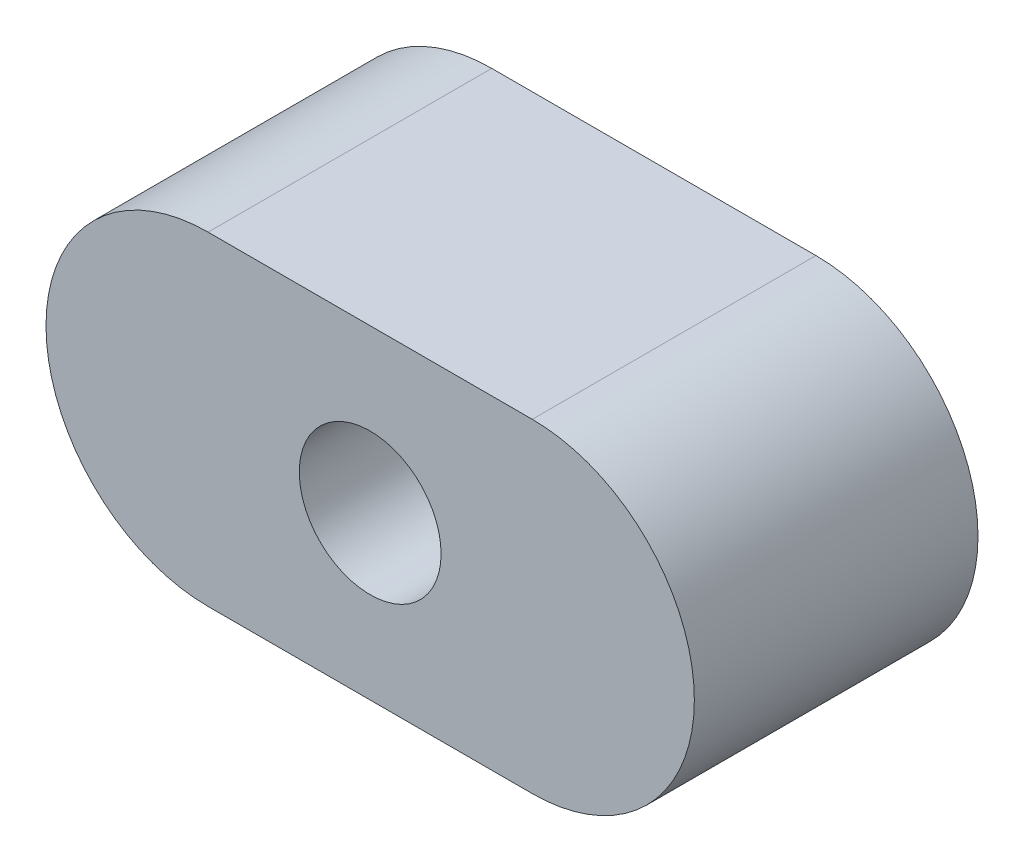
ISO-10303-21;
HEADER;
FILE_DESCRIPTION(('STEP AP214'),'2;1');
FILE_NAME('part.step','',(''),(''),'','','');
FILE_SCHEMA(('AUTOMOTIVE_DESIGN { 1 0 10303 214 1 1 1 1 }'));
ENDSEC;
DATA;
#1=APPLICATION_CONTEXT('core data for automotive mechanical design processes');
#2=APPLICATION_PROTOCOL_DEFINITION('international standard','automotive_design',2000,#1);
#3=PRODUCT_CONTEXT('',#1,'mechanical');
#4=PRODUCT('Part','Part','',(#3));
#5=PRODUCT_RELATED_PRODUCT_CATEGORY('part','',(#4));
#6=PRODUCT_DEFINITION_FORMATION('','',#4);
#7=PRODUCT_DEFINITION_CONTEXT('part definition',#1,'design');
#8=PRODUCT_DEFINITION('design','',#6,#7);
#9=PRODUCT_DEFINITION_SHAPE('','',#8);
#10=(LENGTH_UNIT() NAMED_UNIT(*) SI_UNIT(.MILLI.,.METRE.));
#11=(NAMED_UNIT(*) PLANE_ANGLE_UNIT() SI_UNIT($,.RADIAN.));
#12=(NAMED_UNIT(*) SI_UNIT($,.STERADIAN.) SOLID_ANGLE_UNIT());
#13=UNCERTAINTY_MEASURE_WITH_UNIT(LENGTH_MEASURE(1.E-05),#10,'distance_accuracy_value','');
#14=(GEOMETRIC_REPRESENTATION_CONTEXT(3) GLOBAL_UNCERTAINTY_ASSIGNED_CONTEXT((#13)) GLOBAL_UNIT_ASSIGNED_CONTEXT((#10,
#11,#12)) REPRESENTATION_CONTEXT('',''));
#15=CARTESIAN_POINT('',(0.,0.,0.));
#16=DIRECTION('',(0.,0.,1.));
#17=DIRECTION('',(1.,0.,0.));
#18=AXIS2_PLACEMENT_3D('',#15,#16,#17);
#19=CARTESIAN_POINT('',(-4.,0.,7.));
#20=DIRECTION('',(0.,0.,1.));
#21=DIRECTION('',(1.,0.,0.));
#22=AXIS2_PLACEMENT_3D('',#19,#20,#21);
#23=PLANE('',#22);
#24=CARTESIAN_POINT('',(-4.,0.,7.));
#25=DIRECTION('',(0.,0.,1.));
#26=DIRECTION('',(1.,0.,0.));
#27=AXIS2_PLACEMENT_3D('',#24,#25,#26);
#28=CIRCLE('',#27,4.);
#29=CARTESIAN_POINT('',(-4.,4.,7.));
#30=VERTEX_POINT('',#29);
#31=CARTESIAN_POINT('',(-4.,-4.,7.));
#32=VERTEX_POINT('',#31);
#33=EDGE_CURVE('E87',#30,#32,#28,.T.);
#34=ORIENTED_EDGE('',*,*,#33,.T.);
#35=DIRECTION('',(1.,0.,0.));
#36=VECTOR('',#35,1.);
#37=CARTESIAN_POINT('',(-4.,-4.,7.));
#38=LINE('',#37,#36);
#39=CARTESIAN_POINT('',(4.,-4.,7.));
#40=VERTEX_POINT('',#39);
#41=EDGE_CURVE('E82',#32,#40,#38,.T.);
#42=ORIENTED_EDGE('',*,*,#41,.T.);
#43=CARTESIAN_POINT('',(4.,0.,7.));
#44=DIRECTION('',(0.,0.,1.));
#45=DIRECTION('',(-1.,0.,0.));
#46=AXIS2_PLACEMENT_3D('',#43,#44,#45);
#47=CIRCLE('',#46,4.);
#48=CARTESIAN_POINT('',(4.,4.,7.));
#49=VERTEX_POINT('',#48);
#50=EDGE_CURVE('E85',#40,#49,#47,.T.);
#51=ORIENTED_EDGE('',*,*,#50,.T.);
#52=DIRECTION('',(-1.,0.,0.));
#53=VECTOR('',#52,1.);
#54=CARTESIAN_POINT('',(-4.,4.,7.));
#55=LINE('',#54,#53);
#56=EDGE_CURVE('E52',#49,#30,#55,.T.);
#57=ORIENTED_EDGE('',*,*,#56,.T.);
#58=EDGE_LOOP('',(#34,#42,#51,#57));
#59=FACE_BOUND('',#58,.T.);
#60=CARTESIAN_POINT('',(0.,0.,7.));
#61=DIRECTION('',(0.,0.,1.));
#62=DIRECTION('',(1.,0.,0.));
#63=AXIS2_PLACEMENT_3D('',#60,#61,#62);
#64=CIRCLE('',#63,1.75);
#65=CARTESIAN_POINT('',(1.75,0.,7.));
#66=VERTEX_POINT('',#65);
#67=EDGE_CURVE('E102',#66,#66,#64,.T.);
#68=ORIENTED_EDGE('',*,*,#67,.F.);
#69=EDGE_LOOP('',(#68));
#70=FACE_BOUND('',#69,.T.);
#71=ADVANCED_FACE('F35',(#59,#70),#23,.T.);
#72=CARTESIAN_POINT('',(-4.,0.,0.));
#73=DIRECTION('',(0.,0.,1.));
#74=DIRECTION('',(1.,0.,0.));
#75=AXIS2_PLACEMENT_3D('',#72,#73,#74);
#76=PLANE('',#75);
#77=CARTESIAN_POINT('',(-4.,0.,0.));
#78=DIRECTION('',(0.,0.,1.));
#79=DIRECTION('',(1.,0.,0.));
#80=AXIS2_PLACEMENT_3D('',#77,#78,#79);
#81=CIRCLE('',#80,4.);
#82=CARTESIAN_POINT('',(-4.,4.,0.));
#83=VERTEX_POINT('',#82);
#84=CARTESIAN_POINT('',(-4.,-4.,0.));
#85=VERTEX_POINT('',#84);
#86=EDGE_CURVE('E99',#83,#85,#81,.T.);
#87=ORIENTED_EDGE('',*,*,#86,.F.);
#88=DIRECTION('',(-1.,0.,0.));
#89=VECTOR('',#88,1.);
#90=CARTESIAN_POINT('',(-4.,4.,0.));
#91=LINE('',#90,#89);
#92=CARTESIAN_POINT('',(4.,4.,0.));
#93=VERTEX_POINT('',#92);
#94=EDGE_CURVE('E75',#93,#83,#91,.T.);
#95=ORIENTED_EDGE('',*,*,#94,.F.);
#96=CARTESIAN_POINT('',(4.,0.,0.));
#97=DIRECTION('',(0.,0.,1.));
#98=DIRECTION('',(-1.,0.,0.));
#99=AXIS2_PLACEMENT_3D('',#96,#97,#98);
#100=CIRCLE('',#99,4.);
#101=CARTESIAN_POINT('',(4.,-4.,0.));
#102=VERTEX_POINT('',#101);
#103=EDGE_CURVE('E69',#102,#93,#100,.T.);
#104=ORIENTED_EDGE('',*,*,#103,.F.);
#105=DIRECTION('',(1.,0.,0.));
#106=VECTOR('',#105,1.);
#107=CARTESIAN_POINT('',(-4.,-4.,0.));
#108=LINE('',#107,#106);
#109=EDGE_CURVE('E91',#85,#102,#108,.T.);
#110=ORIENTED_EDGE('',*,*,#109,.F.);
#111=EDGE_LOOP('',(#87,#95,#104,#110));
#112=FACE_BOUND('',#111,.T.);
#113=CARTESIAN_POINT('',(0.,0.,0.));
#114=DIRECTION('',(0.,0.,1.));
#115=DIRECTION('',(1.,0.,0.));
#116=AXIS2_PLACEMENT_3D('',#113,#114,#115);
#117=CIRCLE('',#116,1.75);
#118=CARTESIAN_POINT('',(1.75,0.,0.));
#119=VERTEX_POINT('',#118);
#120=EDGE_CURVE('E114',#119,#119,#117,.T.);
#121=ORIENTED_EDGE('',*,*,#120,.T.);
#122=EDGE_LOOP('',(#121));
#123=FACE_BOUND('',#122,.T.);
#124=ADVANCED_FACE('F110',(#112,#123),#76,.F.);
#125=CARTESIAN_POINT('',(-4.,0.,7.));
#126=DIRECTION('',(0.,0.,-1.));
#127=DIRECTION('',(-1.,0.,0.));
#128=AXIS2_PLACEMENT_3D('',#125,#126,#127);
#129=CYLINDRICAL_SURFACE('',#128,4.);
#130=ORIENTED_EDGE('',*,*,#86,.T.);
#131=DIRECTION('',(0.,0.,-1.));
#132=VECTOR('',#131,1.);
#133=CARTESIAN_POINT('',(-4.,-4.,7.));
#134=LINE('',#133,#132);
#135=EDGE_CURVE('E11',#32,#85,#134,.T.);
#136=ORIENTED_EDGE('',*,*,#135,.F.);
#137=ORIENTED_EDGE('',*,*,#33,.F.);
#138=DIRECTION('',(0.,0.,-1.));
#139=VECTOR('',#138,1.);
#140=CARTESIAN_POINT('',(-4.,4.,7.));
#141=LINE('',#140,#139);
#142=EDGE_CURVE('E95',#30,#83,#141,.T.);
#143=ORIENTED_EDGE('',*,*,#142,.T.);
#144=EDGE_LOOP('',(#130,#136,#137,#143));
#145=FACE_BOUND('',#144,.T.);
#146=ADVANCED_FACE('F37',(#145),#129,.T.);
#147=CARTESIAN_POINT('',(-4.,-4.,7.));
#148=DIRECTION('',(0.,1.,0.));
#149=DIRECTION('',(0.,0.,1.));
#150=AXIS2_PLACEMENT_3D('',#147,#148,#149);
#151=PLANE('',#150);
#152=ORIENTED_EDGE('',*,*,#109,.T.);
#153=DIRECTION('',(0.,0.,-1.));
#154=VECTOR('',#153,1.);
#155=CARTESIAN_POINT('',(4.,-4.,7.));
#156=LINE('',#155,#154);
#157=EDGE_CURVE('E44',#40,#102,#156,.T.);
#158=ORIENTED_EDGE('',*,*,#157,.F.);
#159=ORIENTED_EDGE('',*,*,#41,.F.);
#160=ORIENTED_EDGE('',*,*,#135,.T.);
#161=EDGE_LOOP('',(#152,#158,#159,#160));
#162=FACE_BOUND('',#161,.T.);
#163=ADVANCED_FACE('F90',(#162),#151,.F.);
#164=CARTESIAN_POINT('',(4.,0.,7.));
#165=DIRECTION('',(0.,0.,-1.));
#166=DIRECTION('',(-1.,0.,0.));
#167=AXIS2_PLACEMENT_3D('',#164,#165,#166);
#168=CYLINDRICAL_SURFACE('',#167,4.);
#169=ORIENTED_EDGE('',*,*,#103,.T.);
#170=DIRECTION('',(0.,0.,-1.));
#171=VECTOR('',#170,1.);
#172=CARTESIAN_POINT('',(4.,4.,7.));
#173=LINE('',#172,#171);
#174=EDGE_CURVE('E92',#49,#93,#173,.T.);
#175=ORIENTED_EDGE('',*,*,#174,.F.);
#176=ORIENTED_EDGE('',*,*,#50,.F.);
#177=ORIENTED_EDGE('',*,*,#157,.T.);
#178=EDGE_LOOP('',(#169,#175,#176,#177));
#179=FACE_BOUND('',#178,.T.);
#180=ADVANCED_FACE('F93',(#179),#168,.T.);
#181=CARTESIAN_POINT('',(-4.,4.,7.));
#182=DIRECTION('',(0.,-1.,0.));
#183=DIRECTION('',(0.,0.,-1.));
#184=AXIS2_PLACEMENT_3D('',#181,#182,#183);
#185=PLANE('',#184);
#186=ORIENTED_EDGE('',*,*,#94,.T.);
#187=ORIENTED_EDGE('',*,*,#142,.F.);
#188=ORIENTED_EDGE('',*,*,#56,.F.);
#189=ORIENTED_EDGE('',*,*,#174,.T.);
#190=EDGE_LOOP('',(#186,#187,#188,#189));
#191=FACE_BOUND('',#190,.T.);
#192=ADVANCED_FACE('F107',(#191),#185,.F.);
#193=CARTESIAN_POINT('',(0.,0.,7.));
#194=DIRECTION('',(0.,0.,-1.));
#195=DIRECTION('',(-1.,0.,0.));
#196=AXIS2_PLACEMENT_3D('',#193,#194,#195);
#197=CYLINDRICAL_SURFACE('',#196,1.75);
#198=ORIENTED_EDGE('',*,*,#67,.T.);
#199=EDGE_LOOP('',(#198));
#200=FACE_BOUND('',#199,.T.);
#201=ORIENTED_EDGE('',*,*,#120,.F.);
#202=EDGE_LOOP('',(#201));
#203=FACE_BOUND('',#202,.T.);
#204=ADVANCED_FACE('F120',(#200,#203),#197,.F.);
#205=CLOSED_SHELL('',(#71,#124,#146,#163,#180,#192,#204));
#206=MANIFOLD_SOLID_BREP('B2',#205);
#207=ADVANCED_BREP_SHAPE_REPRESENTATION('',(#18,#206),#14);
#208=SHAPE_DEFINITION_REPRESENTATION(#9,#207);
ENDSEC;
END-ISO-10303-21;
